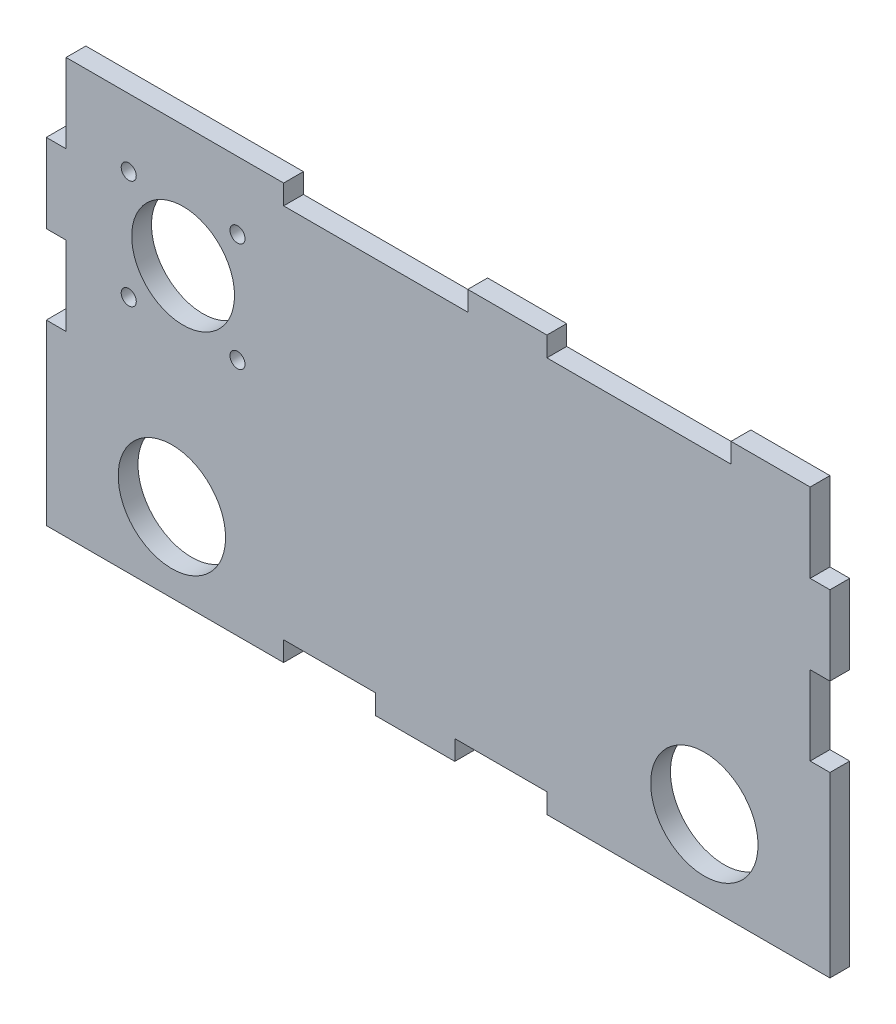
ISO-10303-21;
HEADER;
FILE_DESCRIPTION(('STEP AP214'),'2;1');
FILE_NAME('part.step','',(''),(''),'','','');
FILE_SCHEMA(('AUTOMOTIVE_DESIGN { 1 0 10303 214 1 1 1 1 }'));
ENDSEC;
DATA;
#1=APPLICATION_CONTEXT('core data for automotive mechanical design processes');
#2=APPLICATION_PROTOCOL_DEFINITION('international standard','automotive_design',2000,#1);
#3=PRODUCT_CONTEXT('',#1,'mechanical');
#4=PRODUCT('Part','Part','',(#3));
#5=PRODUCT_RELATED_PRODUCT_CATEGORY('part','',(#4));
#6=PRODUCT_DEFINITION_FORMATION('','',#4);
#7=PRODUCT_DEFINITION_CONTEXT('part definition',#1,'design');
#8=PRODUCT_DEFINITION('design','',#6,#7);
#9=PRODUCT_DEFINITION_SHAPE('','',#8);
#10=(LENGTH_UNIT() NAMED_UNIT(*) SI_UNIT(.MILLI.,.METRE.));
#11=(NAMED_UNIT(*) PLANE_ANGLE_UNIT() SI_UNIT($,.RADIAN.));
#12=(NAMED_UNIT(*) SI_UNIT($,.STERADIAN.) SOLID_ANGLE_UNIT());
#13=UNCERTAINTY_MEASURE_WITH_UNIT(LENGTH_MEASURE(1.E-05),#10,'distance_accuracy_value','');
#14=(GEOMETRIC_REPRESENTATION_CONTEXT(3) GLOBAL_UNCERTAINTY_ASSIGNED_CONTEXT((#13)) GLOBAL_UNIT_ASSIGNED_CONTEXT((#10,
#11,#12)) REPRESENTATION_CONTEXT('',''));
#15=CARTESIAN_POINT('',(0.,0.,0.));
#16=DIRECTION('',(0.,0.,1.));
#17=DIRECTION('',(1.,0.,0.));
#18=AXIS2_PLACEMENT_3D('',#15,#16,#17);
#19=CARTESIAN_POINT('',(0.,0.,5.));
#20=DIRECTION('',(0.,0.,1.));
#21=DIRECTION('',(1.,0.,0.));
#22=AXIS2_PLACEMENT_3D('',#19,#20,#21);
#23=PLANE('',#22);
#24=CARTESIAN_POINT('',(48.3397721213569,87.9243313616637,5.));
#25=DIRECTION('',(0.,0.,1.));
#26=DIRECTION('',(1.,0.,0.));
#27=AXIS2_PLACEMENT_3D('',#24,#25,#26);
#28=CIRCLE('',#27,1.90500000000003);
#29=CARTESIAN_POINT('',(50.2447721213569,87.9243313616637,5.));
#30=VERTEX_POINT('',#29);
#31=EDGE_CURVE('E569',#30,#30,#28,.T.);
#32=ORIENTED_EDGE('',*,*,#31,.F.);
#33=EDGE_LOOP('',(#32));
#34=FACE_BOUND('',#33,.T.);
#35=CARTESIAN_POINT('',(20.8422278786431,60.42678711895,5.));
#36=DIRECTION('',(0.,0.,1.));
#37=DIRECTION('',(1.,0.,0.));
#38=AXIS2_PLACEMENT_3D('',#35,#36,#37);
#39=CIRCLE('',#38,1.90500000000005);
#40=CARTESIAN_POINT('',(22.7472278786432,60.42678711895,5.));
#41=VERTEX_POINT('',#40);
#42=EDGE_CURVE('E581',#41,#41,#39,.T.);
#43=ORIENTED_EDGE('',*,*,#42,.F.);
#44=EDGE_LOOP('',(#43));
#45=FACE_BOUND('',#44,.T.);
#46=CARTESIAN_POINT('',(166.37,20.,5.));
#47=DIRECTION('',(0.,0.,1.));
#48=DIRECTION('',(1.,0.,0.));
#49=AXIS2_PLACEMENT_3D('',#46,#47,#48);
#50=CIRCLE('',#49,13.575);
#51=CARTESIAN_POINT('',(179.945,20.,5.));
#52=VERTEX_POINT('',#51);
#53=EDGE_CURVE('E593',#52,#52,#50,.T.);
#54=ORIENTED_EDGE('',*,*,#53,.F.);
#55=EDGE_LOOP('',(#54));
#56=FACE_BOUND('',#55,.T.);
#57=DIRECTION('',(1.,0.,0.));
#58=VECTOR('',#57,1.);
#59=CARTESIAN_POINT('',(0.,0.,5.));
#60=LINE('',#59,#58);
#61=CARTESIAN_POINT('',(0.,0.,5.));
#62=VERTEX_POINT('',#61);
#63=CARTESIAN_POINT('',(60.,0.,5.));
#64=VERTEX_POINT('',#63);
#65=EDGE_CURVE('E343',#62,#64,#60,.T.);
#66=ORIENTED_EDGE('',*,*,#65,.T.);
#67=DIRECTION('',(0.,1.,0.));
#68=VECTOR('',#67,1.);
#69=CARTESIAN_POINT('',(60.,0.,5.));
#70=LINE('',#69,#68);
#71=CARTESIAN_POINT('',(60.,5.,5.));
#72=VERTEX_POINT('',#71);
#73=EDGE_CURVE('E171',#64,#72,#70,.T.);
#74=ORIENTED_EDGE('',*,*,#73,.T.);
#75=DIRECTION('',(1.,0.,0.));
#76=VECTOR('',#75,1.);
#77=CARTESIAN_POINT('',(60.,5.,5.));
#78=LINE('',#77,#76);
#79=CARTESIAN_POINT('',(83.28,5.,5.));
#80=VERTEX_POINT('',#79);
#81=EDGE_CURVE('E430',#72,#80,#78,.T.);
#82=ORIENTED_EDGE('',*,*,#81,.T.);
#83=DIRECTION('',(0.,-1.,0.));
#84=VECTOR('',#83,1.);
#85=CARTESIAN_POINT('',(83.28,5.,5.));
#86=LINE('',#85,#84);
#87=CARTESIAN_POINT('',(83.28,0.,5.));
#88=VERTEX_POINT('',#87);
#89=EDGE_CURVE('E449',#80,#88,#86,.T.);
#90=ORIENTED_EDGE('',*,*,#89,.T.);
#91=DIRECTION('',(1.,0.,0.));
#92=VECTOR('',#91,1.);
#93=CARTESIAN_POINT('',(83.28,0.,5.));
#94=LINE('',#93,#92);
#95=CARTESIAN_POINT('',(103.28,0.,5.));
#96=VERTEX_POINT('',#95);
#97=EDGE_CURVE('E446',#88,#96,#94,.T.);
#98=ORIENTED_EDGE('',*,*,#97,.T.);
#99=DIRECTION('',(0.,1.,0.));
#100=VECTOR('',#99,1.);
#101=CARTESIAN_POINT('',(103.28,0.,5.));
#102=LINE('',#101,#100);
#103=CARTESIAN_POINT('',(103.28,5.,5.));
#104=VERTEX_POINT('',#103);
#105=EDGE_CURVE('E448',#96,#104,#102,.T.);
#106=ORIENTED_EDGE('',*,*,#105,.T.);
#107=DIRECTION('',(1.,0.,0.));
#108=VECTOR('',#107,1.);
#109=CARTESIAN_POINT('',(103.28,5.,5.));
#110=LINE('',#109,#108);
#111=CARTESIAN_POINT('',(126.56,5.,5.));
#112=VERTEX_POINT('',#111);
#113=EDGE_CURVE('E451',#104,#112,#110,.T.);
#114=ORIENTED_EDGE('',*,*,#113,.T.);
#115=DIRECTION('',(0.,-1.,0.));
#116=VECTOR('',#115,1.);
#117=CARTESIAN_POINT('',(126.56,5.,5.));
#118=LINE('',#117,#116);
#119=CARTESIAN_POINT('',(126.56,0.,5.));
#120=VERTEX_POINT('',#119);
#121=EDGE_CURVE('E457',#112,#120,#118,.T.);
#122=ORIENTED_EDGE('',*,*,#121,.T.);
#123=DIRECTION('',(1.,0.,0.));
#124=VECTOR('',#123,1.);
#125=CARTESIAN_POINT('',(126.56,0.,5.));
#126=LINE('',#125,#124);
#127=CARTESIAN_POINT('',(198.12,0.,5.));
#128=VERTEX_POINT('',#127);
#129=EDGE_CURVE('E459',#120,#128,#126,.T.);
#130=ORIENTED_EDGE('',*,*,#129,.T.);
#131=DIRECTION('',(0.,1.,0.));
#132=VECTOR('',#131,1.);
#133=CARTESIAN_POINT('',(198.12,45.,5.));
#134=LINE('',#133,#132);
#135=CARTESIAN_POINT('',(198.12,45.,5.));
#136=VERTEX_POINT('',#135);
#137=EDGE_CURVE('E461',#128,#136,#134,.T.);
#138=ORIENTED_EDGE('',*,*,#137,.T.);
#139=DIRECTION('',(-1.,0.,0.));
#140=VECTOR('',#139,1.);
#141=CARTESIAN_POINT('',(193.12,45.,5.));
#142=LINE('',#141,#140);
#143=CARTESIAN_POINT('',(193.12,45.,5.));
#144=VERTEX_POINT('',#143);
#145=EDGE_CURVE('E463',#136,#144,#142,.T.);
#146=ORIENTED_EDGE('',*,*,#145,.T.);
#147=DIRECTION('',(0.,1.,0.));
#148=VECTOR('',#147,1.);
#149=CARTESIAN_POINT('',(193.12,65.,5.));
#150=LINE('',#149,#148);
#151=CARTESIAN_POINT('',(193.12,65.,5.));
#152=VERTEX_POINT('',#151);
#153=EDGE_CURVE('E465',#144,#152,#150,.T.);
#154=ORIENTED_EDGE('',*,*,#153,.T.);
#155=DIRECTION('',(1.,0.,0.));
#156=VECTOR('',#155,1.);
#157=CARTESIAN_POINT('',(198.12,65.,5.));
#158=LINE('',#157,#156);
#159=CARTESIAN_POINT('',(198.12,65.,5.));
#160=VERTEX_POINT('',#159);
#161=EDGE_CURVE('E467',#152,#160,#158,.T.);
#162=ORIENTED_EDGE('',*,*,#161,.T.);
#163=DIRECTION('',(0.,1.,0.));
#164=VECTOR('',#163,1.);
#165=CARTESIAN_POINT('',(198.12,85.,5.));
#166=LINE('',#165,#164);
#167=CARTESIAN_POINT('',(198.12,85.,5.));
#168=VERTEX_POINT('',#167);
#169=EDGE_CURVE('E469',#160,#168,#166,.T.);
#170=ORIENTED_EDGE('',*,*,#169,.T.);
#171=DIRECTION('',(-1.,0.,0.));
#172=VECTOR('',#171,1.);
#173=CARTESIAN_POINT('',(193.12,85.,5.));
#174=LINE('',#173,#172);
#175=CARTESIAN_POINT('',(193.12,85.,5.));
#176=VERTEX_POINT('',#175);
#177=EDGE_CURVE('E471',#168,#176,#174,.T.);
#178=ORIENTED_EDGE('',*,*,#177,.T.);
#179=DIRECTION('',(0.,1.,0.));
#180=VECTOR('',#179,1.);
#181=CARTESIAN_POINT('',(193.12,105.,5.));
#182=LINE('',#181,#180);
#183=CARTESIAN_POINT('',(193.12,105.,5.));
#184=VERTEX_POINT('',#183);
#185=EDGE_CURVE('E473',#176,#184,#182,.T.);
#186=ORIENTED_EDGE('',*,*,#185,.T.);
#187=DIRECTION('',(-1.,0.,0.));
#188=VECTOR('',#187,1.);
#189=CARTESIAN_POINT('',(173.12,105.,5.));
#190=LINE('',#189,#188);
#191=CARTESIAN_POINT('',(173.12,105.,5.));
#192=VERTEX_POINT('',#191);
#193=EDGE_CURVE('E475',#184,#192,#190,.T.);
#194=ORIENTED_EDGE('',*,*,#193,.T.);
#195=DIRECTION('',(0.,-1.,0.));
#196=VECTOR('',#195,1.);
#197=CARTESIAN_POINT('',(173.12,100.,5.));
#198=LINE('',#197,#196);
#199=CARTESIAN_POINT('',(173.12,100.,5.));
#200=VERTEX_POINT('',#199);
#201=EDGE_CURVE('E477',#192,#200,#198,.T.);
#202=ORIENTED_EDGE('',*,*,#201,.T.);
#203=DIRECTION('',(-1.,0.,0.));
#204=VECTOR('',#203,1.);
#205=CARTESIAN_POINT('',(126.56,100.,5.));
#206=LINE('',#205,#204);
#207=CARTESIAN_POINT('',(126.56,100.,5.));
#208=VERTEX_POINT('',#207);
#209=EDGE_CURVE('E479',#200,#208,#206,.T.);
#210=ORIENTED_EDGE('',*,*,#209,.T.);
#211=DIRECTION('',(0.,1.,0.));
#212=VECTOR('',#211,1.);
#213=CARTESIAN_POINT('',(126.56,105.,5.));
#214=LINE('',#213,#212);
#215=CARTESIAN_POINT('',(126.56,105.,5.));
#216=VERTEX_POINT('',#215);
#217=EDGE_CURVE('E481',#208,#216,#214,.T.);
#218=ORIENTED_EDGE('',*,*,#217,.T.);
#219=DIRECTION('',(-1.,0.,0.));
#220=VECTOR('',#219,1.);
#221=CARTESIAN_POINT('',(106.56,105.,5.));
#222=LINE('',#221,#220);
#223=CARTESIAN_POINT('',(106.56,105.,5.));
#224=VERTEX_POINT('',#223);
#225=EDGE_CURVE('E483',#216,#224,#222,.T.);
#226=ORIENTED_EDGE('',*,*,#225,.T.);
#227=DIRECTION('',(0.,-1.,0.));
#228=VECTOR('',#227,1.);
#229=CARTESIAN_POINT('',(106.56,100.,5.));
#230=LINE('',#229,#228);
#231=CARTESIAN_POINT('',(106.56,100.,5.));
#232=VERTEX_POINT('',#231);
#233=EDGE_CURVE('E485',#224,#232,#230,.T.);
#234=ORIENTED_EDGE('',*,*,#233,.T.);
#235=DIRECTION('',(-1.,0.,0.));
#236=VECTOR('',#235,1.);
#237=CARTESIAN_POINT('',(60.,100.,5.));
#238=LINE('',#237,#236);
#239=CARTESIAN_POINT('',(60.,100.,5.));
#240=VERTEX_POINT('',#239);
#241=EDGE_CURVE('E487',#232,#240,#238,.T.);
#242=ORIENTED_EDGE('',*,*,#241,.T.);
#243=DIRECTION('',(0.,1.,0.));
#244=VECTOR('',#243,1.);
#245=CARTESIAN_POINT('',(60.,105.,5.));
#246=LINE('',#245,#244);
#247=CARTESIAN_POINT('',(60.,105.,5.));
#248=VERTEX_POINT('',#247);
#249=EDGE_CURVE('E489',#240,#248,#246,.T.);
#250=ORIENTED_EDGE('',*,*,#249,.T.);
#251=DIRECTION('',(-1.,0.,0.));
#252=VECTOR('',#251,1.);
#253=CARTESIAN_POINT('',(5.,105.,5.));
#254=LINE('',#253,#252);
#255=CARTESIAN_POINT('',(5.,105.,5.));
#256=VERTEX_POINT('',#255);
#257=EDGE_CURVE('E491',#248,#256,#254,.T.);
#258=ORIENTED_EDGE('',*,*,#257,.T.);
#259=DIRECTION('',(0.,-1.,0.));
#260=VECTOR('',#259,1.);
#261=CARTESIAN_POINT('',(5.,85.,5.));
#262=LINE('',#261,#260);
#263=CARTESIAN_POINT('',(5.,85.,5.));
#264=VERTEX_POINT('',#263);
#265=EDGE_CURVE('E493',#256,#264,#262,.T.);
#266=ORIENTED_EDGE('',*,*,#265,.T.);
#267=DIRECTION('',(-1.,0.,0.));
#268=VECTOR('',#267,1.);
#269=CARTESIAN_POINT('',(0.,85.,5.));
#270=LINE('',#269,#268);
#271=CARTESIAN_POINT('',(0.,85.,5.));
#272=VERTEX_POINT('',#271);
#273=EDGE_CURVE('E495',#264,#272,#270,.T.);
#274=ORIENTED_EDGE('',*,*,#273,.T.);
#275=DIRECTION('',(0.,-1.,0.));
#276=VECTOR('',#275,1.);
#277=CARTESIAN_POINT('',(0.,65.,5.));
#278=LINE('',#277,#276);
#279=CARTESIAN_POINT('',(0.,65.,5.));
#280=VERTEX_POINT('',#279);
#281=EDGE_CURVE('E497',#272,#280,#278,.T.);
#282=ORIENTED_EDGE('',*,*,#281,.T.);
#283=DIRECTION('',(1.,0.,0.));
#284=VECTOR('',#283,1.);
#285=CARTESIAN_POINT('',(5.,65.,5.));
#286=LINE('',#285,#284);
#287=CARTESIAN_POINT('',(5.,65.,5.));
#288=VERTEX_POINT('',#287);
#289=EDGE_CURVE('E262',#280,#288,#286,.T.);
#290=ORIENTED_EDGE('',*,*,#289,.T.);
#291=DIRECTION('',(0.,-1.,0.));
#292=VECTOR('',#291,1.);
#293=CARTESIAN_POINT('',(5.,45.,5.));
#294=LINE('',#293,#292);
#295=CARTESIAN_POINT('',(5.,45.,5.));
#296=VERTEX_POINT('',#295);
#297=EDGE_CURVE('E256',#288,#296,#294,.T.);
#298=ORIENTED_EDGE('',*,*,#297,.T.);
#299=DIRECTION('',(-1.,0.,0.));
#300=VECTOR('',#299,1.);
#301=CARTESIAN_POINT('',(0.,45.,5.));
#302=LINE('',#301,#300);
#303=CARTESIAN_POINT('',(0.,45.,5.));
#304=VERTEX_POINT('',#303);
#305=EDGE_CURVE('E260',#296,#304,#302,.T.);
#306=ORIENTED_EDGE('',*,*,#305,.T.);
#307=DIRECTION('',(0.,-1.,0.));
#308=VECTOR('',#307,1.);
#309=CARTESIAN_POINT('',(0.,0.,5.));
#310=LINE('',#309,#308);
#311=EDGE_CURVE('E56',#304,#62,#310,.T.);
#312=ORIENTED_EDGE('',*,*,#311,.T.);
#313=EDGE_LOOP('',(#66,#74,#82,#90,#98,#106,#114,#122,#130,#138,#146,#154,#162,#170,#178,#186,
#194,#202,#210,#218,#226,#234,#242,#250,#258,#266,#274,#282,#290,#298,#306,#312));
#314=FACE_BOUND('',#313,.T.);
#315=CARTESIAN_POINT('',(31.75,20.,5.));
#316=DIRECTION('',(0.,0.,1.));
#317=DIRECTION('',(1.,0.,0.));
#318=AXIS2_PLACEMENT_3D('',#315,#316,#317);
#319=CIRCLE('',#318,13.575);
#320=CARTESIAN_POINT('',(45.325,20.,5.));
#321=VERTEX_POINT('',#320);
#322=EDGE_CURVE('E284',#321,#321,#319,.T.);
#323=ORIENTED_EDGE('',*,*,#322,.F.);
#324=EDGE_LOOP('',(#323));
#325=FACE_BOUND('',#324,.T.);
#326=CARTESIAN_POINT('',(20.8422278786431,87.9243313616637,5.));
#327=DIRECTION('',(0.,0.,1.));
#328=DIRECTION('',(1.,0.,0.));
#329=AXIS2_PLACEMENT_3D('',#326,#327,#328);
#330=CIRCLE('',#329,1.90500000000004);
#331=CARTESIAN_POINT('',(22.7472278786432,87.9243313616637,5.));
#332=VERTEX_POINT('',#331);
#333=EDGE_CURVE('E587',#332,#332,#330,.T.);
#334=ORIENTED_EDGE('',*,*,#333,.F.);
#335=EDGE_LOOP('',(#334));
#336=FACE_BOUND('',#335,.T.);
#337=CARTESIAN_POINT('',(48.3397721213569,60.42678711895,5.));
#338=DIRECTION('',(0.,0.,1.));
#339=DIRECTION('',(1.,0.,0.));
#340=AXIS2_PLACEMENT_3D('',#337,#338,#339);
#341=CIRCLE('',#340,1.90500000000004);
#342=CARTESIAN_POINT('',(50.2447721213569,60.42678711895,5.));
#343=VERTEX_POINT('',#342);
#344=EDGE_CURVE('E575',#343,#343,#341,.T.);
#345=ORIENTED_EDGE('',*,*,#344,.F.);
#346=EDGE_LOOP('',(#345));
#347=FACE_BOUND('',#346,.T.);
#348=CARTESIAN_POINT('',(34.591,74.1755592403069,5.));
#349=DIRECTION('',(0.,0.,1.));
#350=DIRECTION('',(1.,0.,0.));
#351=AXIS2_PLACEMENT_3D('',#348,#349,#350);
#352=CIRCLE('',#351,13.);
#353=CARTESIAN_POINT('',(47.591,74.1755592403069,5.));
#354=VERTEX_POINT('',#353);
#355=EDGE_CURVE('E560',#354,#354,#352,.T.);
#356=ORIENTED_EDGE('',*,*,#355,.F.);
#357=EDGE_LOOP('',(#356));
#358=FACE_BOUND('',#357,.T.);
#359=ADVANCED_FACE('F39',(#34,#45,#56,#314,#325,#336,#347,#358),#23,.T.);
#360=CARTESIAN_POINT('',(0.,0.,0.));
#361=DIRECTION('',(0.,0.,1.));
#362=DIRECTION('',(1.,0.,0.));
#363=AXIS2_PLACEMENT_3D('',#360,#361,#362);
#364=PLANE('',#363);
#365=DIRECTION('',(1.,0.,0.));
#366=VECTOR('',#365,1.);
#367=CARTESIAN_POINT('',(0.,0.,0.));
#368=LINE('',#367,#366);
#369=CARTESIAN_POINT('',(0.,0.,0.));
#370=VERTEX_POINT('',#369);
#371=CARTESIAN_POINT('',(60.,0.,0.));
#372=VERTEX_POINT('',#371);
#373=EDGE_CURVE('E280',#370,#372,#368,.T.);
#374=ORIENTED_EDGE('',*,*,#373,.F.);
#375=DIRECTION('',(0.,-1.,0.));
#376=VECTOR('',#375,1.);
#377=CARTESIAN_POINT('',(0.,0.,0.));
#378=LINE('',#377,#376);
#379=CARTESIAN_POINT('',(0.,45.,0.));
#380=VERTEX_POINT('',#379);
#381=EDGE_CURVE('E163',#380,#370,#378,.T.);
#382=ORIENTED_EDGE('',*,*,#381,.F.);
#383=DIRECTION('',(-1.,0.,0.));
#384=VECTOR('',#383,1.);
#385=CARTESIAN_POINT('',(0.,45.,0.));
#386=LINE('',#385,#384);
#387=CARTESIAN_POINT('',(5.,45.,0.));
#388=VERTEX_POINT('',#387);
#389=EDGE_CURVE('E157',#388,#380,#386,.T.);
#390=ORIENTED_EDGE('',*,*,#389,.F.);
#391=DIRECTION('',(0.,-1.,0.));
#392=VECTOR('',#391,1.);
#393=CARTESIAN_POINT('',(5.,45.,0.));
#394=LINE('',#393,#392);
#395=CARTESIAN_POINT('',(5.,65.,0.));
#396=VERTEX_POINT('',#395);
#397=EDGE_CURVE('E270',#396,#388,#394,.T.);
#398=ORIENTED_EDGE('',*,*,#397,.F.);
#399=DIRECTION('',(1.,0.,0.));
#400=VECTOR('',#399,1.);
#401=CARTESIAN_POINT('',(5.,65.,0.));
#402=LINE('',#401,#400);
#403=CARTESIAN_POINT('',(0.,65.,0.));
#404=VERTEX_POINT('',#403);
#405=EDGE_CURVE('E338',#404,#396,#402,.T.);
#406=ORIENTED_EDGE('',*,*,#405,.F.);
#407=DIRECTION('',(0.,-1.,0.));
#408=VECTOR('',#407,1.);
#409=CARTESIAN_POINT('',(0.,65.,0.));
#410=LINE('',#409,#408);
#411=CARTESIAN_POINT('',(0.,85.,0.));
#412=VERTEX_POINT('',#411);
#413=EDGE_CURVE('E336',#412,#404,#410,.T.);
#414=ORIENTED_EDGE('',*,*,#413,.F.);
#415=DIRECTION('',(-1.,0.,0.));
#416=VECTOR('',#415,1.);
#417=CARTESIAN_POINT('',(0.,85.,0.));
#418=LINE('',#417,#416);
#419=CARTESIAN_POINT('',(5.,85.,0.));
#420=VERTEX_POINT('',#419);
#421=EDGE_CURVE('E334',#420,#412,#418,.T.);
#422=ORIENTED_EDGE('',*,*,#421,.F.);
#423=DIRECTION('',(0.,-1.,0.));
#424=VECTOR('',#423,1.);
#425=CARTESIAN_POINT('',(5.,85.,0.));
#426=LINE('',#425,#424);
#427=CARTESIAN_POINT('',(5.,105.,0.));
#428=VERTEX_POINT('',#427);
#429=EDGE_CURVE('E332',#428,#420,#426,.T.);
#430=ORIENTED_EDGE('',*,*,#429,.F.);
#431=DIRECTION('',(-1.,0.,0.));
#432=VECTOR('',#431,1.);
#433=CARTESIAN_POINT('',(5.,105.,0.));
#434=LINE('',#433,#432);
#435=CARTESIAN_POINT('',(60.,105.,0.));
#436=VERTEX_POINT('',#435);
#437=EDGE_CURVE('E330',#436,#428,#434,.T.);
#438=ORIENTED_EDGE('',*,*,#437,.F.);
#439=DIRECTION('',(0.,1.,0.));
#440=VECTOR('',#439,1.);
#441=CARTESIAN_POINT('',(60.,105.,0.));
#442=LINE('',#441,#440);
#443=CARTESIAN_POINT('',(60.,100.,0.));
#444=VERTEX_POINT('',#443);
#445=EDGE_CURVE('E328',#444,#436,#442,.T.);
#446=ORIENTED_EDGE('',*,*,#445,.F.);
#447=DIRECTION('',(-1.,0.,0.));
#448=VECTOR('',#447,1.);
#449=CARTESIAN_POINT('',(60.,100.,0.));
#450=LINE('',#449,#448);
#451=CARTESIAN_POINT('',(106.56,100.,0.));
#452=VERTEX_POINT('',#451);
#453=EDGE_CURVE('E326',#452,#444,#450,.T.);
#454=ORIENTED_EDGE('',*,*,#453,.F.);
#455=DIRECTION('',(0.,-1.,0.));
#456=VECTOR('',#455,1.);
#457=CARTESIAN_POINT('',(106.56,100.,0.));
#458=LINE('',#457,#456);
#459=CARTESIAN_POINT('',(106.56,105.,0.));
#460=VERTEX_POINT('',#459);
#461=EDGE_CURVE('E324',#460,#452,#458,.T.);
#462=ORIENTED_EDGE('',*,*,#461,.F.);
#463=DIRECTION('',(-1.,0.,0.));
#464=VECTOR('',#463,1.);
#465=CARTESIAN_POINT('',(106.56,105.,0.));
#466=LINE('',#465,#464);
#467=CARTESIAN_POINT('',(126.56,105.,0.));
#468=VERTEX_POINT('',#467);
#469=EDGE_CURVE('E322',#468,#460,#466,.T.);
#470=ORIENTED_EDGE('',*,*,#469,.F.);
#471=DIRECTION('',(0.,1.,0.));
#472=VECTOR('',#471,1.);
#473=CARTESIAN_POINT('',(126.56,105.,0.));
#474=LINE('',#473,#472);
#475=CARTESIAN_POINT('',(126.56,100.,0.));
#476=VERTEX_POINT('',#475);
#477=EDGE_CURVE('E320',#476,#468,#474,.T.);
#478=ORIENTED_EDGE('',*,*,#477,.F.);
#479=DIRECTION('',(-1.,0.,0.));
#480=VECTOR('',#479,1.);
#481=CARTESIAN_POINT('',(126.56,100.,0.));
#482=LINE('',#481,#480);
#483=CARTESIAN_POINT('',(173.12,100.,0.));
#484=VERTEX_POINT('',#483);
#485=EDGE_CURVE('E318',#484,#476,#482,.T.);
#486=ORIENTED_EDGE('',*,*,#485,.F.);
#487=DIRECTION('',(0.,-1.,0.));
#488=VECTOR('',#487,1.);
#489=CARTESIAN_POINT('',(173.12,100.,0.));
#490=LINE('',#489,#488);
#491=CARTESIAN_POINT('',(173.12,105.,0.));
#492=VERTEX_POINT('',#491);
#493=EDGE_CURVE('E316',#492,#484,#490,.T.);
#494=ORIENTED_EDGE('',*,*,#493,.F.);
#495=DIRECTION('',(-1.,0.,0.));
#496=VECTOR('',#495,1.);
#497=CARTESIAN_POINT('',(173.12,105.,0.));
#498=LINE('',#497,#496);
#499=CARTESIAN_POINT('',(193.12,105.,0.));
#500=VERTEX_POINT('',#499);
#501=EDGE_CURVE('E314',#500,#492,#498,.T.);
#502=ORIENTED_EDGE('',*,*,#501,.F.);
#503=DIRECTION('',(0.,1.,0.));
#504=VECTOR('',#503,1.);
#505=CARTESIAN_POINT('',(193.12,105.,0.));
#506=LINE('',#505,#504);
#507=CARTESIAN_POINT('',(193.12,85.,0.));
#508=VERTEX_POINT('',#507);
#509=EDGE_CURVE('E312',#508,#500,#506,.T.);
#510=ORIENTED_EDGE('',*,*,#509,.F.);
#511=DIRECTION('',(-1.,0.,0.));
#512=VECTOR('',#511,1.);
#513=CARTESIAN_POINT('',(193.12,85.,0.));
#514=LINE('',#513,#512);
#515=CARTESIAN_POINT('',(198.12,85.,0.));
#516=VERTEX_POINT('',#515);
#517=EDGE_CURVE('E310',#516,#508,#514,.T.);
#518=ORIENTED_EDGE('',*,*,#517,.F.);
#519=DIRECTION('',(0.,1.,0.));
#520=VECTOR('',#519,1.);
#521=CARTESIAN_POINT('',(198.12,85.,0.));
#522=LINE('',#521,#520);
#523=CARTESIAN_POINT('',(198.12,65.,0.));
#524=VERTEX_POINT('',#523);
#525=EDGE_CURVE('E308',#524,#516,#522,.T.);
#526=ORIENTED_EDGE('',*,*,#525,.F.);
#527=DIRECTION('',(1.,0.,0.));
#528=VECTOR('',#527,1.);
#529=CARTESIAN_POINT('',(198.12,65.,0.));
#530=LINE('',#529,#528);
#531=CARTESIAN_POINT('',(193.12,65.,0.));
#532=VERTEX_POINT('',#531);
#533=EDGE_CURVE('E306',#532,#524,#530,.T.);
#534=ORIENTED_EDGE('',*,*,#533,.F.);
#535=DIRECTION('',(0.,1.,0.));
#536=VECTOR('',#535,1.);
#537=CARTESIAN_POINT('',(193.12,65.,0.));
#538=LINE('',#537,#536);
#539=CARTESIAN_POINT('',(193.12,45.,0.));
#540=VERTEX_POINT('',#539);
#541=EDGE_CURVE('E304',#540,#532,#538,.T.);
#542=ORIENTED_EDGE('',*,*,#541,.F.);
#543=DIRECTION('',(-1.,0.,0.));
#544=VECTOR('',#543,1.);
#545=CARTESIAN_POINT('',(193.12,45.,0.));
#546=LINE('',#545,#544);
#547=CARTESIAN_POINT('',(198.12,45.,0.));
#548=VERTEX_POINT('',#547);
#549=EDGE_CURVE('E302',#548,#540,#546,.T.);
#550=ORIENTED_EDGE('',*,*,#549,.F.);
#551=DIRECTION('',(0.,1.,0.));
#552=VECTOR('',#551,1.);
#553=CARTESIAN_POINT('',(198.12,45.,0.));
#554=LINE('',#553,#552);
#555=CARTESIAN_POINT('',(198.12,0.,0.));
#556=VERTEX_POINT('',#555);
#557=EDGE_CURVE('E300',#556,#548,#554,.T.);
#558=ORIENTED_EDGE('',*,*,#557,.F.);
#559=DIRECTION('',(1.,0.,0.));
#560=VECTOR('',#559,1.);
#561=CARTESIAN_POINT('',(126.56,0.,0.));
#562=LINE('',#561,#560);
#563=CARTESIAN_POINT('',(126.56,0.,0.));
#564=VERTEX_POINT('',#563);
#565=EDGE_CURVE('E298',#564,#556,#562,.T.);
#566=ORIENTED_EDGE('',*,*,#565,.F.);
#567=DIRECTION('',(0.,-1.,0.));
#568=VECTOR('',#567,1.);
#569=CARTESIAN_POINT('',(126.56,5.,0.));
#570=LINE('',#569,#568);
#571=CARTESIAN_POINT('',(126.56,5.,0.));
#572=VERTEX_POINT('',#571);
#573=EDGE_CURVE('E296',#572,#564,#570,.T.);
#574=ORIENTED_EDGE('',*,*,#573,.F.);
#575=DIRECTION('',(1.,0.,0.));
#576=VECTOR('',#575,1.);
#577=CARTESIAN_POINT('',(103.28,5.,0.));
#578=LINE('',#577,#576);
#579=CARTESIAN_POINT('',(103.28,5.,0.));
#580=VERTEX_POINT('',#579);
#581=EDGE_CURVE('E294',#580,#572,#578,.T.);
#582=ORIENTED_EDGE('',*,*,#581,.F.);
#583=DIRECTION('',(0.,1.,0.));
#584=VECTOR('',#583,1.);
#585=CARTESIAN_POINT('',(103.28,0.,0.));
#586=LINE('',#585,#584);
#587=CARTESIAN_POINT('',(103.28,0.,0.));
#588=VERTEX_POINT('',#587);
#589=EDGE_CURVE('E292',#588,#580,#586,.T.);
#590=ORIENTED_EDGE('',*,*,#589,.F.);
#591=DIRECTION('',(1.,0.,0.));
#592=VECTOR('',#591,1.);
#593=CARTESIAN_POINT('',(83.28,0.,0.));
#594=LINE('',#593,#592);
#595=CARTESIAN_POINT('',(83.28,0.,0.));
#596=VERTEX_POINT('',#595);
#597=EDGE_CURVE('E290',#596,#588,#594,.T.);
#598=ORIENTED_EDGE('',*,*,#597,.F.);
#599=DIRECTION('',(0.,-1.,0.));
#600=VECTOR('',#599,1.);
#601=CARTESIAN_POINT('',(83.28,5.,0.));
#602=LINE('',#601,#600);
#603=CARTESIAN_POINT('',(83.28,5.,0.));
#604=VERTEX_POINT('',#603);
#605=EDGE_CURVE('E288',#604,#596,#602,.T.);
#606=ORIENTED_EDGE('',*,*,#605,.F.);
#607=DIRECTION('',(1.,0.,0.));
#608=VECTOR('',#607,1.);
#609=CARTESIAN_POINT('',(60.,5.,0.));
#610=LINE('',#609,#608);
#611=CARTESIAN_POINT('',(60.,5.,0.));
#612=VERTEX_POINT('',#611);
#613=EDGE_CURVE('E286',#612,#604,#610,.T.);
#614=ORIENTED_EDGE('',*,*,#613,.F.);
#615=DIRECTION('',(0.,1.,0.));
#616=VECTOR('',#615,1.);
#617=CARTESIAN_POINT('',(60.,0.,0.));
#618=LINE('',#617,#616);
#619=EDGE_CURVE('E283',#372,#612,#618,.T.);
#620=ORIENTED_EDGE('',*,*,#619,.F.);
#621=EDGE_LOOP('',(#374,#382,#390,#398,#406,#414,#422,#430,#438,#446,#454,#462,#470,#478,#486,
#494,#502,#510,#518,#526,#534,#542,#550,#558,#566,#574,#582,#590,#598,#606,#614,#620));
#622=FACE_BOUND('',#621,.T.);
#623=CARTESIAN_POINT('',(31.75,20.,0.));
#624=DIRECTION('',(0.,0.,1.));
#625=DIRECTION('',(1.,0.,0.));
#626=AXIS2_PLACEMENT_3D('',#623,#624,#625);
#627=CIRCLE('',#626,13.575);
#628=CARTESIAN_POINT('',(45.325,20.,0.));
#629=VERTEX_POINT('',#628);
#630=EDGE_CURVE('E596',#629,#629,#627,.T.);
#631=ORIENTED_EDGE('',*,*,#630,.T.);
#632=EDGE_LOOP('',(#631));
#633=FACE_BOUND('',#632,.T.);
#634=CARTESIAN_POINT('',(166.37,20.,0.));
#635=DIRECTION('',(0.,0.,1.));
#636=DIRECTION('',(1.,0.,0.));
#637=AXIS2_PLACEMENT_3D('',#634,#635,#636);
#638=CIRCLE('',#637,13.575);
#639=CARTESIAN_POINT('',(179.945,20.,0.));
#640=VERTEX_POINT('',#639);
#641=EDGE_CURVE('E590',#640,#640,#638,.T.);
#642=ORIENTED_EDGE('',*,*,#641,.T.);
#643=EDGE_LOOP('',(#642));
#644=FACE_BOUND('',#643,.T.);
#645=CARTESIAN_POINT('',(20.8422278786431,87.9243313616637,0.));
#646=DIRECTION('',(0.,0.,1.));
#647=DIRECTION('',(1.,0.,0.));
#648=AXIS2_PLACEMENT_3D('',#645,#646,#647);
#649=CIRCLE('',#648,1.90500000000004);
#650=CARTESIAN_POINT('',(22.7472278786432,87.9243313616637,0.));
#651=VERTEX_POINT('',#650);
#652=EDGE_CURVE('E584',#651,#651,#649,.T.);
#653=ORIENTED_EDGE('',*,*,#652,.T.);
#654=EDGE_LOOP('',(#653));
#655=FACE_BOUND('',#654,.T.);
#656=CARTESIAN_POINT('',(20.8422278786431,60.42678711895,0.));
#657=DIRECTION('',(0.,0.,1.));
#658=DIRECTION('',(1.,0.,0.));
#659=AXIS2_PLACEMENT_3D('',#656,#657,#658);
#660=CIRCLE('',#659,1.90500000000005);
#661=CARTESIAN_POINT('',(22.7472278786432,60.42678711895,0.));
#662=VERTEX_POINT('',#661);
#663=EDGE_CURVE('E578',#662,#662,#660,.T.);
#664=ORIENTED_EDGE('',*,*,#663,.T.);
#665=EDGE_LOOP('',(#664));
#666=FACE_BOUND('',#665,.T.);
#667=CARTESIAN_POINT('',(48.3397721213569,60.42678711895,0.));
#668=DIRECTION('',(0.,0.,1.));
#669=DIRECTION('',(1.,0.,0.));
#670=AXIS2_PLACEMENT_3D('',#667,#668,#669);
#671=CIRCLE('',#670,1.90500000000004);
#672=CARTESIAN_POINT('',(50.2447721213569,60.42678711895,0.));
#673=VERTEX_POINT('',#672);
#674=EDGE_CURVE('E572',#673,#673,#671,.T.);
#675=ORIENTED_EDGE('',*,*,#674,.T.);
#676=EDGE_LOOP('',(#675));
#677=FACE_BOUND('',#676,.T.);
#678=CARTESIAN_POINT('',(48.3397721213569,87.9243313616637,0.));
#679=DIRECTION('',(0.,0.,1.));
#680=DIRECTION('',(1.,0.,0.));
#681=AXIS2_PLACEMENT_3D('',#678,#679,#680);
#682=CIRCLE('',#681,1.90500000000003);
#683=CARTESIAN_POINT('',(50.2447721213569,87.9243313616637,0.));
#684=VERTEX_POINT('',#683);
#685=EDGE_CURVE('E566',#684,#684,#682,.T.);
#686=ORIENTED_EDGE('',*,*,#685,.T.);
#687=EDGE_LOOP('',(#686));
#688=FACE_BOUND('',#687,.T.);
#689=CARTESIAN_POINT('',(34.591,74.1755592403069,0.));
#690=DIRECTION('',(0.,0.,1.));
#691=DIRECTION('',(1.,0.,0.));
#692=AXIS2_PLACEMENT_3D('',#689,#690,#691);
#693=CIRCLE('',#692,13.);
#694=CARTESIAN_POINT('',(47.591,74.1755592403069,0.));
#695=VERTEX_POINT('',#694);
#696=EDGE_CURVE('E563',#695,#695,#693,.T.);
#697=ORIENTED_EDGE('',*,*,#696,.T.);
#698=EDGE_LOOP('',(#697));
#699=FACE_BOUND('',#698,.T.);
#700=ADVANCED_FACE('F434',(#622,#633,#644,#655,#666,#677,#688,#699),#364,.F.);
#701=CARTESIAN_POINT('',(0.,0.,5.));
#702=DIRECTION('',(0.,1.,0.));
#703=DIRECTION('',(0.,0.,1.));
#704=AXIS2_PLACEMENT_3D('',#701,#702,#703);
#705=PLANE('',#704);
#706=ORIENTED_EDGE('',*,*,#373,.T.);
#707=DIRECTION('',(0.,0.,-1.));
#708=VECTOR('',#707,1.);
#709=CARTESIAN_POINT('',(60.,0.,5.));
#710=LINE('',#709,#708);
#711=EDGE_CURVE('E11',#64,#372,#710,.T.);
#712=ORIENTED_EDGE('',*,*,#711,.F.);
#713=ORIENTED_EDGE('',*,*,#65,.F.);
#714=DIRECTION('',(0.,0.,-1.));
#715=VECTOR('',#714,1.);
#716=CARTESIAN_POINT('',(0.,0.,5.));
#717=LINE('',#716,#715);
#718=EDGE_CURVE('E276',#62,#370,#717,.T.);
#719=ORIENTED_EDGE('',*,*,#718,.T.);
#720=EDGE_LOOP('',(#706,#712,#713,#719));
#721=FACE_BOUND('',#720,.T.);
#722=ADVANCED_FACE('F41',(#721),#705,.F.);
#723=CARTESIAN_POINT('',(60.,0.,5.));
#724=DIRECTION('',(-1.,0.,0.));
#725=DIRECTION('',(0.,0.,1.));
#726=AXIS2_PLACEMENT_3D('',#723,#724,#725);
#727=PLANE('',#726);
#728=ORIENTED_EDGE('',*,*,#619,.T.);
#729=DIRECTION('',(0.,0.,-1.));
#730=VECTOR('',#729,1.);
#731=CARTESIAN_POINT('',(60.,5.,5.));
#732=LINE('',#731,#730);
#733=EDGE_CURVE('E48',#72,#612,#732,.T.);
#734=ORIENTED_EDGE('',*,*,#733,.F.);
#735=ORIENTED_EDGE('',*,*,#73,.F.);
#736=ORIENTED_EDGE('',*,*,#711,.T.);
#737=EDGE_LOOP('',(#728,#734,#735,#736));
#738=FACE_BOUND('',#737,.T.);
#739=ADVANCED_FACE('F963',(#738),#727,.F.);
#740=CARTESIAN_POINT('',(60.,5.,5.));
#741=DIRECTION('',(0.,1.,0.));
#742=DIRECTION('',(0.,0.,1.));
#743=AXIS2_PLACEMENT_3D('',#740,#741,#742);
#744=PLANE('',#743);
#745=ORIENTED_EDGE('',*,*,#613,.T.);
#746=DIRECTION('',(0.,0.,-1.));
#747=VECTOR('',#746,1.);
#748=CARTESIAN_POINT('',(83.28,5.,5.));
#749=LINE('',#748,#747);
#750=EDGE_CURVE('E422',#80,#604,#749,.T.);
#751=ORIENTED_EDGE('',*,*,#750,.F.);
#752=ORIENTED_EDGE('',*,*,#81,.F.);
#753=ORIENTED_EDGE('',*,*,#733,.T.);
#754=EDGE_LOOP('',(#745,#751,#752,#753));
#755=FACE_BOUND('',#754,.T.);
#756=ADVANCED_FACE('F428',(#755),#744,.F.);
#757=CARTESIAN_POINT('',(83.28,5.,5.));
#758=DIRECTION('',(1.,0.,0.));
#759=DIRECTION('',(0.,0.,-1.));
#760=AXIS2_PLACEMENT_3D('',#757,#758,#759);
#761=PLANE('',#760);
#762=ORIENTED_EDGE('',*,*,#605,.T.);
#763=DIRECTION('',(0.,0.,-1.));
#764=VECTOR('',#763,1.);
#765=CARTESIAN_POINT('',(83.28,0.,5.));
#766=LINE('',#765,#764);
#767=EDGE_CURVE('E419',#88,#596,#766,.T.);
#768=ORIENTED_EDGE('',*,*,#767,.F.);
#769=ORIENTED_EDGE('',*,*,#89,.F.);
#770=ORIENTED_EDGE('',*,*,#750,.T.);
#771=EDGE_LOOP('',(#762,#768,#769,#770));
#772=FACE_BOUND('',#771,.T.);
#773=ADVANCED_FACE('F440',(#772),#761,.F.);
#774=CARTESIAN_POINT('',(83.28,0.,5.));
#775=DIRECTION('',(0.,1.,0.));
#776=DIRECTION('',(0.,0.,1.));
#777=AXIS2_PLACEMENT_3D('',#774,#775,#776);
#778=PLANE('',#777);
#779=ORIENTED_EDGE('',*,*,#597,.T.);
#780=DIRECTION('',(0.,0.,-1.));
#781=VECTOR('',#780,1.);
#782=CARTESIAN_POINT('',(103.28,0.,5.));
#783=LINE('',#782,#781);
#784=EDGE_CURVE('E416',#96,#588,#783,.T.);
#785=ORIENTED_EDGE('',*,*,#784,.F.);
#786=ORIENTED_EDGE('',*,*,#97,.F.);
#787=ORIENTED_EDGE('',*,*,#767,.T.);
#788=EDGE_LOOP('',(#779,#785,#786,#787));
#789=FACE_BOUND('',#788,.T.);
#790=ADVANCED_FACE('F444',(#789),#778,.F.);
#791=CARTESIAN_POINT('',(103.28,0.,5.));
#792=DIRECTION('',(-1.,0.,0.));
#793=DIRECTION('',(0.,0.,1.));
#794=AXIS2_PLACEMENT_3D('',#791,#792,#793);
#795=PLANE('',#794);
#796=ORIENTED_EDGE('',*,*,#589,.T.);
#797=DIRECTION('',(0.,0.,-1.));
#798=VECTOR('',#797,1.);
#799=CARTESIAN_POINT('',(103.28,5.,5.));
#800=LINE('',#799,#798);
#801=EDGE_CURVE('E413',#104,#580,#800,.T.);
#802=ORIENTED_EDGE('',*,*,#801,.F.);
#803=ORIENTED_EDGE('',*,*,#105,.F.);
#804=ORIENTED_EDGE('',*,*,#784,.T.);
#805=EDGE_LOOP('',(#796,#802,#803,#804));
#806=FACE_BOUND('',#805,.T.);
#807=ADVANCED_FACE('F924',(#806),#795,.F.);
#808=CARTESIAN_POINT('',(103.28,5.,5.));
#809=DIRECTION('',(0.,1.,0.));
#810=DIRECTION('',(0.,0.,1.));
#811=AXIS2_PLACEMENT_3D('',#808,#809,#810);
#812=PLANE('',#811);
#813=ORIENTED_EDGE('',*,*,#581,.T.);
#814=DIRECTION('',(0.,0.,-1.));
#815=VECTOR('',#814,1.);
#816=CARTESIAN_POINT('',(126.56,5.,5.));
#817=LINE('',#816,#815);
#818=EDGE_CURVE('E410',#112,#572,#817,.T.);
#819=ORIENTED_EDGE('',*,*,#818,.F.);
#820=ORIENTED_EDGE('',*,*,#113,.F.);
#821=ORIENTED_EDGE('',*,*,#801,.T.);
#822=EDGE_LOOP('',(#813,#819,#820,#821));
#823=FACE_BOUND('',#822,.T.);
#824=ADVANCED_FACE('F913',(#823),#812,.F.);
#825=CARTESIAN_POINT('',(126.56,5.,5.));
#826=DIRECTION('',(1.,0.,0.));
#827=DIRECTION('',(0.,0.,-1.));
#828=AXIS2_PLACEMENT_3D('',#825,#826,#827);
#829=PLANE('',#828);
#830=ORIENTED_EDGE('',*,*,#573,.T.);
#831=DIRECTION('',(0.,0.,-1.));
#832=VECTOR('',#831,1.);
#833=CARTESIAN_POINT('',(126.56,0.,5.));
#834=LINE('',#833,#832);
#835=EDGE_CURVE('E407',#120,#564,#834,.T.);
#836=ORIENTED_EDGE('',*,*,#835,.F.);
#837=ORIENTED_EDGE('',*,*,#121,.F.);
#838=ORIENTED_EDGE('',*,*,#818,.T.);
#839=EDGE_LOOP('',(#830,#836,#837,#838));
#840=FACE_BOUND('',#839,.T.);
#841=ADVANCED_FACE('F902',(#840),#829,.F.);
#842=CARTESIAN_POINT('',(126.56,0.,5.));
#843=DIRECTION('',(0.,1.,0.));
#844=DIRECTION('',(0.,0.,1.));
#845=AXIS2_PLACEMENT_3D('',#842,#843,#844);
#846=PLANE('',#845);
#847=ORIENTED_EDGE('',*,*,#565,.T.);
#848=DIRECTION('',(0.,0.,-1.));
#849=VECTOR('',#848,1.);
#850=CARTESIAN_POINT('',(198.12,0.,5.));
#851=LINE('',#850,#849);
#852=EDGE_CURVE('E404',#128,#556,#851,.T.);
#853=ORIENTED_EDGE('',*,*,#852,.F.);
#854=ORIENTED_EDGE('',*,*,#129,.F.);
#855=ORIENTED_EDGE('',*,*,#835,.T.);
#856=EDGE_LOOP('',(#847,#853,#854,#855));
#857=FACE_BOUND('',#856,.T.);
#858=ADVANCED_FACE('F891',(#857),#846,.F.);
#859=CARTESIAN_POINT('',(198.12,45.,5.));
#860=DIRECTION('',(-1.,0.,0.));
#861=DIRECTION('',(0.,0.,1.));
#862=AXIS2_PLACEMENT_3D('',#859,#860,#861);
#863=PLANE('',#862);
#864=ORIENTED_EDGE('',*,*,#557,.T.);
#865=DIRECTION('',(0.,0.,-1.));
#866=VECTOR('',#865,1.);
#867=CARTESIAN_POINT('',(198.12,45.,5.));
#868=LINE('',#867,#866);
#869=EDGE_CURVE('E401',#136,#548,#868,.T.);
#870=ORIENTED_EDGE('',*,*,#869,.F.);
#871=ORIENTED_EDGE('',*,*,#137,.F.);
#872=ORIENTED_EDGE('',*,*,#852,.T.);
#873=EDGE_LOOP('',(#864,#870,#871,#872));
#874=FACE_BOUND('',#873,.T.);
#875=ADVANCED_FACE('F880',(#874),#863,.F.);
#876=CARTESIAN_POINT('',(193.12,45.,5.));
#877=DIRECTION('',(0.,-1.,0.));
#878=DIRECTION('',(0.,0.,-1.));
#879=AXIS2_PLACEMENT_3D('',#876,#877,#878);
#880=PLANE('',#879);
#881=ORIENTED_EDGE('',*,*,#549,.T.);
#882=DIRECTION('',(0.,0.,-1.));
#883=VECTOR('',#882,1.);
#884=CARTESIAN_POINT('',(193.12,45.,5.));
#885=LINE('',#884,#883);
#886=EDGE_CURVE('E398',#144,#540,#885,.T.);
#887=ORIENTED_EDGE('',*,*,#886,.F.);
#888=ORIENTED_EDGE('',*,*,#145,.F.);
#889=ORIENTED_EDGE('',*,*,#869,.T.);
#890=EDGE_LOOP('',(#881,#887,#888,#889));
#891=FACE_BOUND('',#890,.T.);
#892=ADVANCED_FACE('F869',(#891),#880,.F.);
#893=CARTESIAN_POINT('',(193.12,65.,5.));
#894=DIRECTION('',(-1.,0.,0.));
#895=DIRECTION('',(0.,0.,1.));
#896=AXIS2_PLACEMENT_3D('',#893,#894,#895);
#897=PLANE('',#896);
#898=ORIENTED_EDGE('',*,*,#541,.T.);
#899=DIRECTION('',(0.,0.,-1.));
#900=VECTOR('',#899,1.);
#901=CARTESIAN_POINT('',(193.12,65.,5.));
#902=LINE('',#901,#900);
#903=EDGE_CURVE('E395',#152,#532,#902,.T.);
#904=ORIENTED_EDGE('',*,*,#903,.F.);
#905=ORIENTED_EDGE('',*,*,#153,.F.);
#906=ORIENTED_EDGE('',*,*,#886,.T.);
#907=EDGE_LOOP('',(#898,#904,#905,#906));
#908=FACE_BOUND('',#907,.T.);
#909=ADVANCED_FACE('F858',(#908),#897,.F.);
#910=CARTESIAN_POINT('',(198.12,65.,5.));
#911=DIRECTION('',(0.,1.,0.));
#912=DIRECTION('',(0.,0.,1.));
#913=AXIS2_PLACEMENT_3D('',#910,#911,#912);
#914=PLANE('',#913);
#915=ORIENTED_EDGE('',*,*,#533,.T.);
#916=DIRECTION('',(0.,0.,-1.));
#917=VECTOR('',#916,1.);
#918=CARTESIAN_POINT('',(198.12,65.,5.));
#919=LINE('',#918,#917);
#920=EDGE_CURVE('E392',#160,#524,#919,.T.);
#921=ORIENTED_EDGE('',*,*,#920,.F.);
#922=ORIENTED_EDGE('',*,*,#161,.F.);
#923=ORIENTED_EDGE('',*,*,#903,.T.);
#924=EDGE_LOOP('',(#915,#921,#922,#923));
#925=FACE_BOUND('',#924,.T.);
#926=ADVANCED_FACE('F847',(#925),#914,.F.);
#927=CARTESIAN_POINT('',(198.12,85.,5.));
#928=DIRECTION('',(-1.,0.,0.));
#929=DIRECTION('',(0.,0.,1.));
#930=AXIS2_PLACEMENT_3D('',#927,#928,#929);
#931=PLANE('',#930);
#932=ORIENTED_EDGE('',*,*,#525,.T.);
#933=DIRECTION('',(0.,0.,-1.));
#934=VECTOR('',#933,1.);
#935=CARTESIAN_POINT('',(198.12,85.,5.));
#936=LINE('',#935,#934);
#937=EDGE_CURVE('E389',#168,#516,#936,.T.);
#938=ORIENTED_EDGE('',*,*,#937,.F.);
#939=ORIENTED_EDGE('',*,*,#169,.F.);
#940=ORIENTED_EDGE('',*,*,#920,.T.);
#941=EDGE_LOOP('',(#932,#938,#939,#940));
#942=FACE_BOUND('',#941,.T.);
#943=ADVANCED_FACE('F836',(#942),#931,.F.);
#944=CARTESIAN_POINT('',(193.12,85.,5.));
#945=DIRECTION('',(0.,-1.,0.));
#946=DIRECTION('',(0.,0.,-1.));
#947=AXIS2_PLACEMENT_3D('',#944,#945,#946);
#948=PLANE('',#947);
#949=ORIENTED_EDGE('',*,*,#517,.T.);
#950=DIRECTION('',(0.,0.,-1.));
#951=VECTOR('',#950,1.);
#952=CARTESIAN_POINT('',(193.12,85.,5.));
#953=LINE('',#952,#951);
#954=EDGE_CURVE('E386',#176,#508,#953,.T.);
#955=ORIENTED_EDGE('',*,*,#954,.F.);
#956=ORIENTED_EDGE('',*,*,#177,.F.);
#957=ORIENTED_EDGE('',*,*,#937,.T.);
#958=EDGE_LOOP('',(#949,#955,#956,#957));
#959=FACE_BOUND('',#958,.T.);
#960=ADVANCED_FACE('F825',(#959),#948,.F.);
#961=CARTESIAN_POINT('',(193.12,105.,5.));
#962=DIRECTION('',(-1.,0.,0.));
#963=DIRECTION('',(0.,0.,1.));
#964=AXIS2_PLACEMENT_3D('',#961,#962,#963);
#965=PLANE('',#964);
#966=ORIENTED_EDGE('',*,*,#509,.T.);
#967=DIRECTION('',(0.,0.,-1.));
#968=VECTOR('',#967,1.);
#969=CARTESIAN_POINT('',(193.12,105.,5.));
#970=LINE('',#969,#968);
#971=EDGE_CURVE('E383',#184,#500,#970,.T.);
#972=ORIENTED_EDGE('',*,*,#971,.F.);
#973=ORIENTED_EDGE('',*,*,#185,.F.);
#974=ORIENTED_EDGE('',*,*,#954,.T.);
#975=EDGE_LOOP('',(#966,#972,#973,#974));
#976=FACE_BOUND('',#975,.T.);
#977=ADVANCED_FACE('F814',(#976),#965,.F.);
#978=CARTESIAN_POINT('',(173.12,105.,5.));
#979=DIRECTION('',(0.,-1.,0.));
#980=DIRECTION('',(0.,0.,-1.));
#981=AXIS2_PLACEMENT_3D('',#978,#979,#980);
#982=PLANE('',#981);
#983=ORIENTED_EDGE('',*,*,#501,.T.);
#984=DIRECTION('',(0.,0.,-1.));
#985=VECTOR('',#984,1.);
#986=CARTESIAN_POINT('',(173.12,105.,5.));
#987=LINE('',#986,#985);
#988=EDGE_CURVE('E380',#192,#492,#987,.T.);
#989=ORIENTED_EDGE('',*,*,#988,.F.);
#990=ORIENTED_EDGE('',*,*,#193,.F.);
#991=ORIENTED_EDGE('',*,*,#971,.T.);
#992=EDGE_LOOP('',(#983,#989,#990,#991));
#993=FACE_BOUND('',#992,.T.);
#994=ADVANCED_FACE('F803',(#993),#982,.F.);
#995=CARTESIAN_POINT('',(173.12,100.,5.));
#996=DIRECTION('',(1.,0.,0.));
#997=DIRECTION('',(0.,1.,0.));
#998=AXIS2_PLACEMENT_3D('',#995,#996,#997);
#999=PLANE('',#998);
#1000=ORIENTED_EDGE('',*,*,#493,.T.);
#1001=DIRECTION('',(0.,0.,-1.));
#1002=VECTOR('',#1001,1.);
#1003=CARTESIAN_POINT('',(173.12,100.,5.));
#1004=LINE('',#1003,#1002);
#1005=EDGE_CURVE('E377',#200,#484,#1004,.T.);
#1006=ORIENTED_EDGE('',*,*,#1005,.F.);
#1007=ORIENTED_EDGE('',*,*,#201,.F.);
#1008=ORIENTED_EDGE('',*,*,#988,.T.);
#1009=EDGE_LOOP('',(#1000,#1006,#1007,#1008));
#1010=FACE_BOUND('',#1009,.T.);
#1011=ADVANCED_FACE('F792',(#1010),#999,.F.);
#1012=CARTESIAN_POINT('',(126.56,100.,5.));
#1013=DIRECTION('',(0.,-1.,0.));
#1014=DIRECTION('',(0.,0.,-1.));
#1015=AXIS2_PLACEMENT_3D('',#1012,#1013,#1014);
#1016=PLANE('',#1015);
#1017=ORIENTED_EDGE('',*,*,#485,.T.);
#1018=DIRECTION('',(0.,0.,-1.));
#1019=VECTOR('',#1018,1.);
#1020=CARTESIAN_POINT('',(126.56,100.,5.));
#1021=LINE('',#1020,#1019);
#1022=EDGE_CURVE('E374',#208,#476,#1021,.T.);
#1023=ORIENTED_EDGE('',*,*,#1022,.F.);
#1024=ORIENTED_EDGE('',*,*,#209,.F.);
#1025=ORIENTED_EDGE('',*,*,#1005,.T.);
#1026=EDGE_LOOP('',(#1017,#1023,#1024,#1025));
#1027=FACE_BOUND('',#1026,.T.);
#1028=ADVANCED_FACE('F781',(#1027),#1016,.F.);
#1029=CARTESIAN_POINT('',(126.56,105.,5.));
#1030=DIRECTION('',(-1.,0.,0.));
#1031=DIRECTION('',(0.,0.,1.));
#1032=AXIS2_PLACEMENT_3D('',#1029,#1030,#1031);
#1033=PLANE('',#1032);
#1034=ORIENTED_EDGE('',*,*,#477,.T.);
#1035=DIRECTION('',(0.,0.,-1.));
#1036=VECTOR('',#1035,1.);
#1037=CARTESIAN_POINT('',(126.56,105.,5.));
#1038=LINE('',#1037,#1036);
#1039=EDGE_CURVE('E371',#216,#468,#1038,.T.);
#1040=ORIENTED_EDGE('',*,*,#1039,.F.);
#1041=ORIENTED_EDGE('',*,*,#217,.F.);
#1042=ORIENTED_EDGE('',*,*,#1022,.T.);
#1043=EDGE_LOOP('',(#1034,#1040,#1041,#1042));
#1044=FACE_BOUND('',#1043,.T.);
#1045=ADVANCED_FACE('F770',(#1044),#1033,.F.);
#1046=CARTESIAN_POINT('',(106.56,105.,5.));
#1047=DIRECTION('',(0.,-1.,0.));
#1048=DIRECTION('',(0.,0.,-1.));
#1049=AXIS2_PLACEMENT_3D('',#1046,#1047,#1048);
#1050=PLANE('',#1049);
#1051=ORIENTED_EDGE('',*,*,#469,.T.);
#1052=DIRECTION('',(0.,0.,-1.));
#1053=VECTOR('',#1052,1.);
#1054=CARTESIAN_POINT('',(106.56,105.,5.));
#1055=LINE('',#1054,#1053);
#1056=EDGE_CURVE('E368',#224,#460,#1055,.T.);
#1057=ORIENTED_EDGE('',*,*,#1056,.F.);
#1058=ORIENTED_EDGE('',*,*,#225,.F.);
#1059=ORIENTED_EDGE('',*,*,#1039,.T.);
#1060=EDGE_LOOP('',(#1051,#1057,#1058,#1059));
#1061=FACE_BOUND('',#1060,.T.);
#1062=ADVANCED_FACE('F759',(#1061),#1050,.F.);
#1063=CARTESIAN_POINT('',(106.56,100.,5.));
#1064=DIRECTION('',(1.,0.,0.));
#1065=DIRECTION('',(0.,0.,-1.));
#1066=AXIS2_PLACEMENT_3D('',#1063,#1064,#1065);
#1067=PLANE('',#1066);
#1068=ORIENTED_EDGE('',*,*,#461,.T.);
#1069=DIRECTION('',(0.,0.,-1.));
#1070=VECTOR('',#1069,1.);
#1071=CARTESIAN_POINT('',(106.56,100.,5.));
#1072=LINE('',#1071,#1070);
#1073=EDGE_CURVE('E365',#232,#452,#1072,.T.);
#1074=ORIENTED_EDGE('',*,*,#1073,.F.);
#1075=ORIENTED_EDGE('',*,*,#233,.F.);
#1076=ORIENTED_EDGE('',*,*,#1056,.T.);
#1077=EDGE_LOOP('',(#1068,#1074,#1075,#1076));
#1078=FACE_BOUND('',#1077,.T.);
#1079=ADVANCED_FACE('F748',(#1078),#1067,.F.);
#1080=CARTESIAN_POINT('',(60.,100.,5.));
#1081=DIRECTION('',(0.,-1.,0.));
#1082=DIRECTION('',(0.,0.,-1.));
#1083=AXIS2_PLACEMENT_3D('',#1080,#1081,#1082);
#1084=PLANE('',#1083);
#1085=ORIENTED_EDGE('',*,*,#453,.T.);
#1086=DIRECTION('',(0.,0.,-1.));
#1087=VECTOR('',#1086,1.);
#1088=CARTESIAN_POINT('',(60.,100.,5.));
#1089=LINE('',#1088,#1087);
#1090=EDGE_CURVE('E362',#240,#444,#1089,.T.);
#1091=ORIENTED_EDGE('',*,*,#1090,.F.);
#1092=ORIENTED_EDGE('',*,*,#241,.F.);
#1093=ORIENTED_EDGE('',*,*,#1073,.T.);
#1094=EDGE_LOOP('',(#1085,#1091,#1092,#1093));
#1095=FACE_BOUND('',#1094,.T.);
#1096=ADVANCED_FACE('F737',(#1095),#1084,.F.);
#1097=CARTESIAN_POINT('',(60.,105.,5.));
#1098=DIRECTION('',(-1.,0.,0.));
#1099=DIRECTION('',(0.,0.,1.));
#1100=AXIS2_PLACEMENT_3D('',#1097,#1098,#1099);
#1101=PLANE('',#1100);
#1102=ORIENTED_EDGE('',*,*,#445,.T.);
#1103=DIRECTION('',(0.,0.,-1.));
#1104=VECTOR('',#1103,1.);
#1105=CARTESIAN_POINT('',(60.,105.,5.));
#1106=LINE('',#1105,#1104);
#1107=EDGE_CURVE('E359',#248,#436,#1106,.T.);
#1108=ORIENTED_EDGE('',*,*,#1107,.F.);
#1109=ORIENTED_EDGE('',*,*,#249,.F.);
#1110=ORIENTED_EDGE('',*,*,#1090,.T.);
#1111=EDGE_LOOP('',(#1102,#1108,#1109,#1110));
#1112=FACE_BOUND('',#1111,.T.);
#1113=ADVANCED_FACE('F726',(#1112),#1101,.F.);
#1114=CARTESIAN_POINT('',(5.,105.,5.));
#1115=DIRECTION('',(0.,-1.,0.));
#1116=DIRECTION('',(0.,0.,-1.));
#1117=AXIS2_PLACEMENT_3D('',#1114,#1115,#1116);
#1118=PLANE('',#1117);
#1119=ORIENTED_EDGE('',*,*,#437,.T.);
#1120=DIRECTION('',(0.,0.,-1.));
#1121=VECTOR('',#1120,1.);
#1122=CARTESIAN_POINT('',(5.,105.,5.));
#1123=LINE('',#1122,#1121);
#1124=EDGE_CURVE('E356',#256,#428,#1123,.T.);
#1125=ORIENTED_EDGE('',*,*,#1124,.F.);
#1126=ORIENTED_EDGE('',*,*,#257,.F.);
#1127=ORIENTED_EDGE('',*,*,#1107,.T.);
#1128=EDGE_LOOP('',(#1119,#1125,#1126,#1127));
#1129=FACE_BOUND('',#1128,.T.);
#1130=ADVANCED_FACE('F715',(#1129),#1118,.F.);
#1131=CARTESIAN_POINT('',(5.,85.,5.));
#1132=DIRECTION('',(1.,0.,0.));
#1133=DIRECTION('',(0.,0.,-1.));
#1134=AXIS2_PLACEMENT_3D('',#1131,#1132,#1133);
#1135=PLANE('',#1134);
#1136=ORIENTED_EDGE('',*,*,#429,.T.);
#1137=DIRECTION('',(0.,0.,-1.));
#1138=VECTOR('',#1137,1.);
#1139=CARTESIAN_POINT('',(5.,85.,5.));
#1140=LINE('',#1139,#1138);
#1141=EDGE_CURVE('E353',#264,#420,#1140,.T.);
#1142=ORIENTED_EDGE('',*,*,#1141,.F.);
#1143=ORIENTED_EDGE('',*,*,#265,.F.);
#1144=ORIENTED_EDGE('',*,*,#1124,.T.);
#1145=EDGE_LOOP('',(#1136,#1142,#1143,#1144));
#1146=FACE_BOUND('',#1145,.T.);
#1147=ADVANCED_FACE('F704',(#1146),#1135,.F.);
#1148=CARTESIAN_POINT('',(0.,85.,5.));
#1149=DIRECTION('',(0.,-1.,0.));
#1150=DIRECTION('',(0.,0.,-1.));
#1151=AXIS2_PLACEMENT_3D('',#1148,#1149,#1150);
#1152=PLANE('',#1151);
#1153=ORIENTED_EDGE('',*,*,#421,.T.);
#1154=DIRECTION('',(0.,0.,-1.));
#1155=VECTOR('',#1154,1.);
#1156=CARTESIAN_POINT('',(0.,85.,5.));
#1157=LINE('',#1156,#1155);
#1158=EDGE_CURVE('E350',#272,#412,#1157,.T.);
#1159=ORIENTED_EDGE('',*,*,#1158,.F.);
#1160=ORIENTED_EDGE('',*,*,#273,.F.);
#1161=ORIENTED_EDGE('',*,*,#1141,.T.);
#1162=EDGE_LOOP('',(#1153,#1159,#1160,#1161));
#1163=FACE_BOUND('',#1162,.T.);
#1164=ADVANCED_FACE('F694',(#1163),#1152,.F.);
#1165=CARTESIAN_POINT('',(0.,65.,5.));
#1166=DIRECTION('',(1.,0.,0.));
#1167=DIRECTION('',(0.,0.,-1.));
#1168=AXIS2_PLACEMENT_3D('',#1165,#1166,#1167);
#1169=PLANE('',#1168);
#1170=ORIENTED_EDGE('',*,*,#413,.T.);
#1171=DIRECTION('',(0.,0.,-1.));
#1172=VECTOR('',#1171,1.);
#1173=CARTESIAN_POINT('',(0.,65.,5.));
#1174=LINE('',#1173,#1172);
#1175=EDGE_CURVE('E347',#280,#404,#1174,.T.);
#1176=ORIENTED_EDGE('',*,*,#1175,.F.);
#1177=ORIENTED_EDGE('',*,*,#281,.F.);
#1178=ORIENTED_EDGE('',*,*,#1158,.T.);
#1179=EDGE_LOOP('',(#1170,#1176,#1177,#1178));
#1180=FACE_BOUND('',#1179,.T.);
#1181=ADVANCED_FACE('F503',(#1180),#1169,.F.);
#1182=CARTESIAN_POINT('',(5.,65.,5.));
#1183=DIRECTION('',(0.,1.,0.));
#1184=DIRECTION('',(0.,0.,1.));
#1185=AXIS2_PLACEMENT_3D('',#1182,#1183,#1184);
#1186=PLANE('',#1185);
#1187=ORIENTED_EDGE('',*,*,#405,.T.);
#1188=DIRECTION('',(0.,0.,-1.));
#1189=VECTOR('',#1188,1.);
#1190=CARTESIAN_POINT('',(5.,65.,5.));
#1191=LINE('',#1190,#1189);
#1192=EDGE_CURVE('E271',#288,#396,#1191,.T.);
#1193=ORIENTED_EDGE('',*,*,#1192,.F.);
#1194=ORIENTED_EDGE('',*,*,#289,.F.);
#1195=ORIENTED_EDGE('',*,*,#1175,.T.);
#1196=EDGE_LOOP('',(#1187,#1193,#1194,#1195));
#1197=FACE_BOUND('',#1196,.T.);
#1198=ADVANCED_FACE('F507',(#1197),#1186,.F.);
#1199=CARTESIAN_POINT('',(5.,45.,5.));
#1200=DIRECTION('',(1.,0.,0.));
#1201=DIRECTION('',(0.,1.,0.));
#1202=AXIS2_PLACEMENT_3D('',#1199,#1200,#1201);
#1203=PLANE('',#1202);
#1204=ORIENTED_EDGE('',*,*,#397,.T.);
#1205=DIRECTION('',(0.,0.,-1.));
#1206=VECTOR('',#1205,1.);
#1207=CARTESIAN_POINT('',(5.,45.,5.));
#1208=LINE('',#1207,#1206);
#1209=EDGE_CURVE('E267',#296,#388,#1208,.T.);
#1210=ORIENTED_EDGE('',*,*,#1209,.F.);
#1211=ORIENTED_EDGE('',*,*,#297,.F.);
#1212=ORIENTED_EDGE('',*,*,#1192,.T.);
#1213=EDGE_LOOP('',(#1204,#1210,#1211,#1212));
#1214=FACE_BOUND('',#1213,.T.);
#1215=ADVANCED_FACE('F268',(#1214),#1203,.F.);
#1216=CARTESIAN_POINT('',(0.,45.,5.));
#1217=DIRECTION('',(0.,-1.,0.));
#1218=DIRECTION('',(0.,0.,-1.));
#1219=AXIS2_PLACEMENT_3D('',#1216,#1217,#1218);
#1220=PLANE('',#1219);
#1221=ORIENTED_EDGE('',*,*,#389,.T.);
#1222=DIRECTION('',(0.,0.,-1.));
#1223=VECTOR('',#1222,1.);
#1224=CARTESIAN_POINT('',(0.,45.,5.));
#1225=LINE('',#1224,#1223);
#1226=EDGE_CURVE('E272',#304,#380,#1225,.T.);
#1227=ORIENTED_EDGE('',*,*,#1226,.F.);
#1228=ORIENTED_EDGE('',*,*,#305,.F.);
#1229=ORIENTED_EDGE('',*,*,#1209,.T.);
#1230=EDGE_LOOP('',(#1221,#1227,#1228,#1229));
#1231=FACE_BOUND('',#1230,.T.);
#1232=ADVANCED_FACE('F274',(#1231),#1220,.F.);
#1233=CARTESIAN_POINT('',(0.,0.,5.));
#1234=DIRECTION('',(1.,0.,0.));
#1235=DIRECTION('',(0.,0.,-1.));
#1236=AXIS2_PLACEMENT_3D('',#1233,#1234,#1235);
#1237=PLANE('',#1236);
#1238=ORIENTED_EDGE('',*,*,#381,.T.);
#1239=ORIENTED_EDGE('',*,*,#718,.F.);
#1240=ORIENTED_EDGE('',*,*,#311,.F.);
#1241=ORIENTED_EDGE('',*,*,#1226,.T.);
#1242=EDGE_LOOP('',(#1238,#1239,#1240,#1241));
#1243=FACE_BOUND('',#1242,.T.);
#1244=ADVANCED_FACE('F511',(#1243),#1237,.F.);
#1245=CARTESIAN_POINT('',(31.75,20.,5.));
#1246=DIRECTION('',(0.,0.,-1.));
#1247=DIRECTION('',(-1.,0.,0.));
#1248=AXIS2_PLACEMENT_3D('',#1245,#1246,#1247);
#1249=CYLINDRICAL_SURFACE('',#1248,13.575);
#1250=ORIENTED_EDGE('',*,*,#322,.T.);
#1251=EDGE_LOOP('',(#1250));
#1252=FACE_BOUND('',#1251,.T.);
#1253=ORIENTED_EDGE('',*,*,#630,.F.);
#1254=EDGE_LOOP('',(#1253));
#1255=FACE_BOUND('',#1254,.T.);
#1256=ADVANCED_FACE('F513',(#1252,#1255),#1249,.F.);
#1257=CARTESIAN_POINT('',(166.37,20.,5.));
#1258=DIRECTION('',(0.,0.,-1.));
#1259=DIRECTION('',(-1.,0.,0.));
#1260=AXIS2_PLACEMENT_3D('',#1257,#1258,#1259);
#1261=CYLINDRICAL_SURFACE('',#1260,13.575);
#1262=ORIENTED_EDGE('',*,*,#53,.T.);
#1263=EDGE_LOOP('',(#1262));
#1264=FACE_BOUND('',#1263,.T.);
#1265=ORIENTED_EDGE('',*,*,#641,.F.);
#1266=EDGE_LOOP('',(#1265));
#1267=FACE_BOUND('',#1266,.T.);
#1268=ADVANCED_FACE('F519',(#1264,#1267),#1261,.F.);
#1269=CARTESIAN_POINT('',(20.8422278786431,87.9243313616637,5.));
#1270=DIRECTION('',(0.,0.,-1.));
#1271=DIRECTION('',(-1.,0.,0.));
#1272=AXIS2_PLACEMENT_3D('',#1269,#1270,#1271);
#1273=CYLINDRICAL_SURFACE('',#1272,1.90500000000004);
#1274=ORIENTED_EDGE('',*,*,#333,.T.);
#1275=EDGE_LOOP('',(#1274));
#1276=FACE_BOUND('',#1275,.T.);
#1277=ORIENTED_EDGE('',*,*,#652,.F.);
#1278=EDGE_LOOP('',(#1277));
#1279=FACE_BOUND('',#1278,.T.);
#1280=ADVANCED_FACE('F535',(#1276,#1279),#1273,.F.);
#1281=CARTESIAN_POINT('',(20.8422278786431,60.42678711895,5.));
#1282=DIRECTION('',(0.,0.,-1.));
#1283=DIRECTION('',(-1.,0.,0.));
#1284=AXIS2_PLACEMENT_3D('',#1281,#1282,#1283);
#1285=CYLINDRICAL_SURFACE('',#1284,1.90500000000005);
#1286=ORIENTED_EDGE('',*,*,#42,.T.);
#1287=EDGE_LOOP('',(#1286));
#1288=FACE_BOUND('',#1287,.T.);
#1289=ORIENTED_EDGE('',*,*,#663,.F.);
#1290=EDGE_LOOP('',(#1289));
#1291=FACE_BOUND('',#1290,.T.);
#1292=ADVANCED_FACE('F539',(#1288,#1291),#1285,.F.);
#1293=CARTESIAN_POINT('',(48.3397721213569,60.42678711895,5.));
#1294=DIRECTION('',(0.,0.,-1.));
#1295=DIRECTION('',(-1.,0.,0.));
#1296=AXIS2_PLACEMENT_3D('',#1293,#1294,#1295);
#1297=CYLINDRICAL_SURFACE('',#1296,1.90500000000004);
#1298=ORIENTED_EDGE('',*,*,#344,.T.);
#1299=EDGE_LOOP('',(#1298));
#1300=FACE_BOUND('',#1299,.T.);
#1301=ORIENTED_EDGE('',*,*,#674,.F.);
#1302=EDGE_LOOP('',(#1301));
#1303=FACE_BOUND('',#1302,.T.);
#1304=ADVANCED_FACE('F543',(#1300,#1303),#1297,.F.);
#1305=CARTESIAN_POINT('',(48.3397721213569,87.9243313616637,5.));
#1306=DIRECTION('',(0.,0.,-1.));
#1307=DIRECTION('',(-1.,0.,0.));
#1308=AXIS2_PLACEMENT_3D('',#1305,#1306,#1307);
#1309=CYLINDRICAL_SURFACE('',#1308,1.90500000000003);
#1310=ORIENTED_EDGE('',*,*,#31,.T.);
#1311=EDGE_LOOP('',(#1310));
#1312=FACE_BOUND('',#1311,.T.);
#1313=ORIENTED_EDGE('',*,*,#685,.F.);
#1314=EDGE_LOOP('',(#1313));
#1315=FACE_BOUND('',#1314,.T.);
#1316=ADVANCED_FACE('F547',(#1312,#1315),#1309,.F.);
#1317=CARTESIAN_POINT('',(34.591,74.1755592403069,5.));
#1318=DIRECTION('',(0.,0.,-1.));
#1319=DIRECTION('',(-1.,0.,0.));
#1320=AXIS2_PLACEMENT_3D('',#1317,#1318,#1319);
#1321=CYLINDRICAL_SURFACE('',#1320,13.);
#1322=ORIENTED_EDGE('',*,*,#355,.T.);
#1323=EDGE_LOOP('',(#1322));
#1324=FACE_BOUND('',#1323,.T.);
#1325=ORIENTED_EDGE('',*,*,#696,.F.);
#1326=EDGE_LOOP('',(#1325));
#1327=FACE_BOUND('',#1326,.T.);
#1328=ADVANCED_FACE('F551',(#1324,#1327),#1321,.F.);
#1329=CLOSED_SHELL('',(#359,#700,#722,#739,#756,#773,#790,#807,#824,#841,#858,#875,#892,#909,
#926,#943,#960,#977,#994,#1011,#1028,#1045,#1062,#1079,#1096,#1113,#1130,#1147,#1164,#1181,
#1198,#1215,#1232,#1244,#1256,#1268,#1280,#1292,#1304,#1316,#1328));
#1330=MANIFOLD_SOLID_BREP('B2',#1329);
#1331=ADVANCED_BREP_SHAPE_REPRESENTATION('',(#18,#1330),#14);
#1332=SHAPE_DEFINITION_REPRESENTATION(#9,#1331);
ENDSEC;
END-ISO-10303-21;
